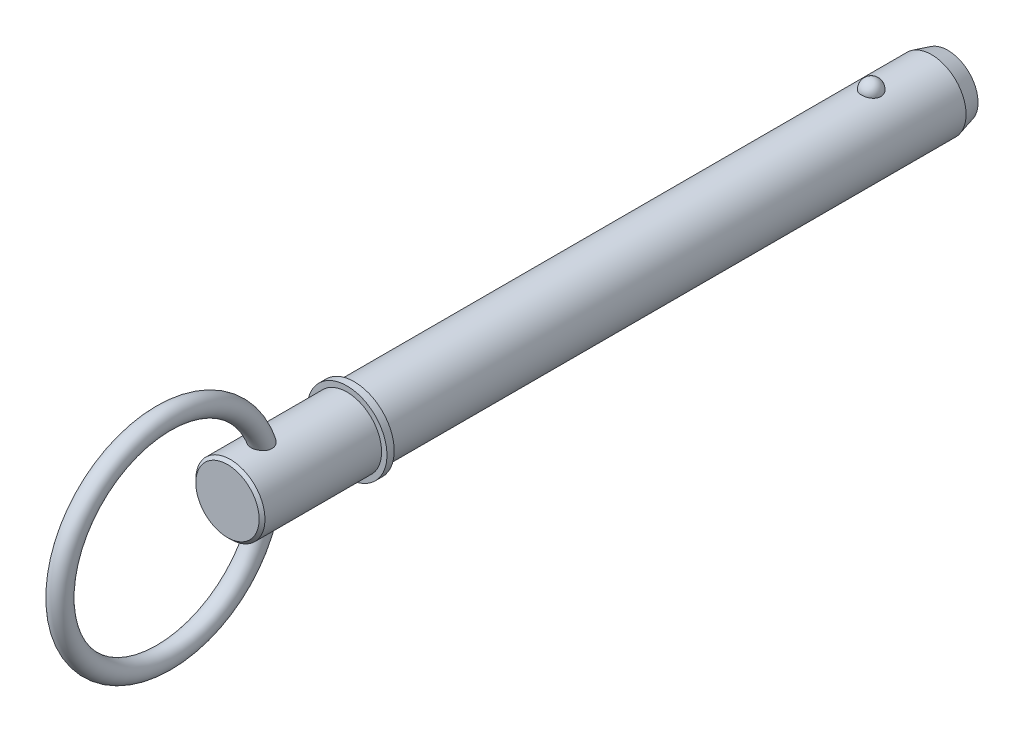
ISO-10303-21;
HEADER;
FILE_DESCRIPTION(('STEP AP214'),'2;1');
FILE_NAME('part.step','',(''),(''),'','','');
FILE_SCHEMA(('AUTOMOTIVE_DESIGN { 1 0 10303 214 1 1 1 1 }'));
ENDSEC;
DATA;
#1=APPLICATION_CONTEXT('core data for automotive mechanical design processes');
#2=APPLICATION_PROTOCOL_DEFINITION('international standard','automotive_design',2000,#1);
#3=PRODUCT_CONTEXT('',#1,'mechanical');
#4=PRODUCT('Part','Part','',(#3));
#5=PRODUCT_RELATED_PRODUCT_CATEGORY('part','',(#4));
#6=PRODUCT_DEFINITION_FORMATION('','',#4);
#7=PRODUCT_DEFINITION_CONTEXT('part definition',#1,'design');
#8=PRODUCT_DEFINITION('design','',#6,#7);
#9=PRODUCT_DEFINITION_SHAPE('','',#8);
#10=(LENGTH_UNIT() NAMED_UNIT(*) SI_UNIT(.MILLI.,.METRE.));
#11=(NAMED_UNIT(*) PLANE_ANGLE_UNIT() SI_UNIT($,.RADIAN.));
#12=(NAMED_UNIT(*) SI_UNIT($,.STERADIAN.) SOLID_ANGLE_UNIT());
#13=UNCERTAINTY_MEASURE_WITH_UNIT(LENGTH_MEASURE(1.E-05),#10,'distance_accuracy_value','');
#14=(GEOMETRIC_REPRESENTATION_CONTEXT(3) GLOBAL_UNCERTAINTY_ASSIGNED_CONTEXT((#13)) GLOBAL_UNIT_ASSIGNED_CONTEXT((#10,
#11,#12)) REPRESENTATION_CONTEXT('',''));
#15=CARTESIAN_POINT('',(0.,0.,0.));
#16=DIRECTION('',(0.,0.,1.));
#17=DIRECTION('',(1.,0.,0.));
#18=AXIS2_PLACEMENT_3D('',#15,#16,#17);
#19=CARTESIAN_POINT('',(0.,0.,139.7));
#20=DIRECTION('',(0.,0.,-1.));
#21=DIRECTION('',(-1.,0.,0.));
#22=AXIS2_PLACEMENT_3D('',#19,#20,#21);
#23=CYLINDRICAL_SURFACE('',#22,9.525);
#24=CARTESIAN_POINT('',(2.66304631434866,9.14515223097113,-2.68999999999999));
#25=CARTESIAN_POINT('',(2.66304388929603,9.14515434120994,-2.53964785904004));
#26=CARTESIAN_POINT('',(2.65079171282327,9.14874785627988,-2.38926509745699));
#27=CARTESIAN_POINT('',(2.60207590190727,9.16272073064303,-2.09276319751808));
#28=CARTESIAN_POINT('',(2.5656035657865,9.17310252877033,-1.94664561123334));
#29=CARTESIAN_POINT('',(2.469373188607,9.19947238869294,-1.66290124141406));
#30=CARTESIAN_POINT('',(2.40962536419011,9.215457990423,-1.52527076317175));
#31=CARTESIAN_POINT('',(2.26832639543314,9.25124900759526,-1.26225231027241));
#32=CARTESIAN_POINT('',(2.1867756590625,9.27105435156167,-1.13686410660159));
#33=CARTESIAN_POINT('',(2.00344089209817,9.3123948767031,-0.901158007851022));
#34=CARTESIAN_POINT('',(1.90155748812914,9.33393823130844,-0.790918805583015));
#35=CARTESIAN_POINT('',(1.68043702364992,9.37626794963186,-0.589299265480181));
#36=CARTESIAN_POINT('',(1.56119995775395,9.397054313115,-0.497918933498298));
#37=CARTESIAN_POINT('',(1.30893044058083,9.43549335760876,-0.336812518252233));
#38=CARTESIAN_POINT('',(1.17593917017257,9.45315498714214,-0.267024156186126));
#39=CARTESIAN_POINT('',(0.8995966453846,9.48344056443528,-0.150749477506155));
#40=CARTESIAN_POINT('',(0.756246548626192,9.49606507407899,-0.104260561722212));
#41=CARTESIAN_POINT('',(0.466048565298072,9.51468193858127,-0.0365733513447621));
#42=CARTESIAN_POINT('',(0.319312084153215,9.52079100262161,-0.014929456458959));
#43=CARTESIAN_POINT('',(0.0241592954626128,9.52611235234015,0.00395337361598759));
#44=CARTESIAN_POINT('',(-0.124256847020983,9.5253253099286,0.00119468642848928));
#45=CARTESIAN_POINT('',(-0.41628168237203,9.51700443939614,-0.0284230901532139));
#46=CARTESIAN_POINT('',(-0.559928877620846,9.50956858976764,-0.0549321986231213));
#47=CARTESIAN_POINT('',(-0.840604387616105,9.48887888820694,-0.130816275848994));
#48=CARTESIAN_POINT('',(-0.977632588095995,9.47562493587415,-0.180191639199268));
#49=CARTESIAN_POINT('',(-1.24212223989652,9.44460733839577,-0.300803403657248));
#50=CARTESIAN_POINT('',(-1.36952298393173,9.42681774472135,-0.372166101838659));
#51=CARTESIAN_POINT('',(-1.61053183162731,9.38864858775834,-0.534729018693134));
#52=CARTESIAN_POINT('',(-1.72413851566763,9.36826875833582,-0.625931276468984));
#53=CARTESIAN_POINT('',(-1.9367483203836,9.32666137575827,-0.827716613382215));
#54=CARTESIAN_POINT('',(-2.03542624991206,9.3054250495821,-0.938640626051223));
#55=CARTESIAN_POINT('',(-2.21301001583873,9.26480083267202,-1.17562728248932));
#56=CARTESIAN_POINT('',(-2.29191442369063,9.24541307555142,-1.3016910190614));
#57=CARTESIAN_POINT('',(-2.4288038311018,9.21040769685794,-1.56709947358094));
#58=CARTESIAN_POINT('',(-2.48653332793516,9.19483682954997,-1.70658229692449));
#59=CARTESIAN_POINT('',(-2.57830950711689,9.16952722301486,-1.99363485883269));
#60=CARTESIAN_POINT('',(-2.61235688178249,9.1597883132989,-2.14120436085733));
#61=CARTESIAN_POINT('',(-2.65582131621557,9.14728131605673,-2.43957517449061));
#62=CARTESIAN_POINT('',(-2.66534248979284,9.14448376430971,-2.59036007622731));
#63=CARTESIAN_POINT('',(-2.659816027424,9.1460926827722,-2.89143694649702));
#64=CARTESIAN_POINT('',(-2.64476907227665,9.15049895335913,-3.04172892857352));
#65=CARTESIAN_POINT('',(-2.59062526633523,9.16597303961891,-3.3367616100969));
#66=CARTESIAN_POINT('',(-2.55165119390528,9.17700684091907,-3.48152666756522));
#67=CARTESIAN_POINT('',(-2.45072334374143,9.20447158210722,-3.7622672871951));
#68=CARTESIAN_POINT('',(-2.38876863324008,9.22090274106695,-3.89824249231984));
#69=CARTESIAN_POINT('',(-2.24300082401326,9.25744165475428,-4.15838266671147));
#70=CARTESIAN_POINT('',(-2.15906901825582,9.27756919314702,-4.28247834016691));
#71=CARTESIAN_POINT('',(-1.97161008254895,9.31920445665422,-4.51460755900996));
#72=CARTESIAN_POINT('',(-1.86808218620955,9.34071223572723,-4.62264047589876));
#73=CARTESIAN_POINT('',(-1.64365852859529,9.38280712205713,-4.82005417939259));
#74=CARTESIAN_POINT('',(-1.52269814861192,9.40339041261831,-4.90936239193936));
#75=CARTESIAN_POINT('',(-1.26696810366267,9.44124442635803,-5.06628635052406));
#76=CARTESIAN_POINT('',(-1.13219941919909,9.45851538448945,-5.13390363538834));
#77=CARTESIAN_POINT('',(-0.854427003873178,9.48761400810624,-5.24478918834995));
#78=CARTESIAN_POINT('',(-0.711548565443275,9.49950757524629,-5.28835378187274));
#79=CARTESIAN_POINT('',(-0.420167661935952,9.51684639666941,-5.35116010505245));
#80=CARTESIAN_POINT('',(-0.271665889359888,9.52229244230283,-5.3704048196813));
#81=CARTESIAN_POINT('',(0.0236961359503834,9.52609381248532,-5.38387805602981));
#82=CARTESIAN_POINT('',(0.170533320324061,9.52458300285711,-5.37857884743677));
#83=CARTESIAN_POINT('',(0.461166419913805,9.51494050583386,-5.34419624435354));
#84=CARTESIAN_POINT('',(0.604962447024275,9.50680906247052,-5.31511372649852));
#85=CARTESIAN_POINT('',(0.884899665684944,9.48484202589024,-5.23415185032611));
#86=CARTESIAN_POINT('',(1.02106863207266,9.47102889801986,-5.18236222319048));
#87=CARTESIAN_POINT('',(1.28268503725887,9.43915933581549,-5.05742910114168));
#88=CARTESIAN_POINT('',(1.40813178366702,9.421102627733,-4.98428422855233));
#89=CARTESIAN_POINT('',(1.64690915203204,9.38233399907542,-4.8172920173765));
#90=CARTESIAN_POINT('',(1.76002050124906,9.36158508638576,-4.72313982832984));
#91=CARTESIAN_POINT('',(1.96897358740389,9.31987907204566,-4.51732444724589));
#92=CARTESIAN_POINT('',(2.06481234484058,9.29892193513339,-4.40565824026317));
#93=CARTESIAN_POINT('',(2.23837433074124,9.25869342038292,-4.16566572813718));
#94=CARTESIAN_POINT('',(2.31574652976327,9.23945848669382,-4.03707931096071));
#95=CARTESIAN_POINT('',(2.44818540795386,9.20525491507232,-3.76840633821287));
#96=CARTESIAN_POINT('',(2.50325979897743,9.19028480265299,-3.6283237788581));
#97=CARTESIAN_POINT('',(2.58510224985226,9.16757716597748,-3.35610038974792));
#98=CARTESIAN_POINT('',(2.61427951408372,9.15923447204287,-3.2247283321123));
#99=CARTESIAN_POINT('',(2.6532524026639,9.14802112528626,-2.95891229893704));
#100=CARTESIAN_POINT('',(2.66304848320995,9.1451503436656,-2.82446839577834));
#101=CARTESIAN_POINT('',(2.66304631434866,9.14515223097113,-2.68999999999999));
#102=B_SPLINE_CURVE_WITH_KNOTS('',3,(#24,#25,#26,#27,#28,#29,#30,#31,#32,#33,#34,#35,#36,#37,
#38,#39,#40,#41,#42,#43,#44,#45,#46,#47,#48,#49,#50,#51,#52,#53,#54,#55,#56,#57,#58,#59,#60,#61,
#62,#63,#64,#65,#66,#67,#68,#69,#70,#71,#72,#73,#74,#75,#76,#77,#78,#79,#80,#81,#82,#83,#84,#85,
#86,#87,#88,#89,#90,#91,#92,#93,#94,#95,#96,#97,#98,#99,#100,#101),.UNSPECIFIED.,.T.,.F.,(4,2,2,
2,2,2,2,2,2,2,2,2,2,2,2,2,2,2,2,2,2,2,2,2,2,2,2,2,2,2,2,2,2,2,2,2,2,2,4),(0.,0.450573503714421,
0.901308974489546,1.35184682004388,1.80237623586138,2.25516399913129,2.70795190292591,
3.15942136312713,3.61084044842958,4.0540301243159,4.49717661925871,4.9338984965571,
5.37062791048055,5.80991423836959,6.24924573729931,6.69708004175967,7.1449466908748,
7.5980522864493,8.0511446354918,8.50231041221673,8.95346368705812,9.40232106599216,
9.85119666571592,10.3025487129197,10.7539184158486,11.2070064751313,11.6600623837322,
12.1074045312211,12.5546917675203,12.9934085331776,13.4321091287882,13.8690915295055,
14.3061021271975,14.7499227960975,15.1938199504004,15.6455814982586,16.0971866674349,
16.5001694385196,16.9031427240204),.UNSPECIFIED.);
#103=CARTESIAN_POINT('',(2.66304631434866,9.14515223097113,-2.68999999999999));
#104=VERTEX_POINT('',#103);
#105=EDGE_CURVE('E100',#104,#104,#102,.T.);
#106=ORIENTED_EDGE('',*,*,#105,.T.);
#107=EDGE_LOOP('',(#106));
#108=FACE_BOUND('',#107,.T.);
#109=CARTESIAN_POINT('',(0.,0.,-19.3));
#110=DIRECTION('',(0.,0.,-1.));
#111=DIRECTION('',(-1.,0.,0.));
#112=AXIS2_PLACEMENT_3D('',#109,#110,#111);
#113=CIRCLE('',#112,9.525);
#114=CARTESIAN_POINT('',(-9.525,0.,-19.3));
#115=VERTEX_POINT('',#114);
#116=EDGE_CURVE('E108',#115,#115,#113,.F.);
#117=ORIENTED_EDGE('',*,*,#116,.T.);
#118=EDGE_LOOP('',(#117));
#119=FACE_BOUND('',#118,.T.);
#120=CARTESIAN_POINT('',(0.,0.,139.7));
#121=DIRECTION('',(0.,0.,1.));
#122=DIRECTION('',(1.,0.,0.));
#123=AXIS2_PLACEMENT_3D('',#120,#121,#122);
#124=CIRCLE('',#123,9.525);
#125=CARTESIAN_POINT('',(9.525,0.,139.7));
#126=VERTEX_POINT('',#125);
#127=EDGE_CURVE('E106',#126,#126,#124,.T.);
#128=ORIENTED_EDGE('',*,*,#127,.F.);
#129=EDGE_LOOP('',(#128));
#130=FACE_BOUND('',#129,.T.);
#131=ADVANCED_FACE('F39',(#108,#119,#130),#23,.T.);
#132=CARTESIAN_POINT('',(0.,0.,-23.8));
#133=DIRECTION('',(0.,0.,-1.));
#134=DIRECTION('',(-1.,0.,0.));
#135=AXIS2_PLACEMENT_3D('',#132,#133,#134);
#136=PLANE('',#135);
#137=CARTESIAN_POINT('',(0.,0.,-23.8));
#138=DIRECTION('',(0.,0.,-1.));
#139=DIRECTION('',(-1.,0.,0.));
#140=AXIS2_PLACEMENT_3D('',#137,#138,#139);
#141=CIRCLE('',#140,8.31922863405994);
#142=CARTESIAN_POINT('',(-8.31922863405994,0.,-23.8));
#143=VERTEX_POINT('',#142);
#144=EDGE_CURVE('E143',#143,#143,#141,.T.);
#145=ORIENTED_EDGE('',*,*,#144,.T.);
#146=EDGE_LOOP('',(#145));
#147=FACE_BOUND('',#146,.T.);
#148=ADVANCED_FACE('F86',(#147),#136,.T.);
#149=CARTESIAN_POINT('',(0.,0.,-23.8));
#150=DIRECTION('',(0.,0.,1.));
#151=DIRECTION('',(1.,0.,0.));
#152=AXIS2_PLACEMENT_3D('',#149,#150,#151);
#153=CONICAL_SURFACE('',#152,8.31922863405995,0.261799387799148);
#154=ORIENTED_EDGE('',*,*,#116,.F.);
#155=EDGE_LOOP('',(#154));
#156=FACE_BOUND('',#155,.T.);
#157=ORIENTED_EDGE('',*,*,#144,.F.);
#158=EDGE_LOOP('',(#157));
#159=FACE_BOUND('',#158,.T.);
#160=ADVANCED_FACE('F92',(#156,#159),#153,.T.);
#161=CARTESIAN_POINT('',(0.,9.525,-2.68999999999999));
#162=DIRECTION('',(0.,1.,0.));
#163=DIRECTION('',(0.,0.,1.));
#164=AXIS2_PLACEMENT_3D('',#161,#162,#163);
#165=SPHERICAL_SURFACE('',#164,2.69);
#166=ORIENTED_EDGE('',*,*,#105,.F.);
#167=EDGE_LOOP('',(#166));
#168=FACE_BOUND('',#167,.T.);
#169=ADVANCED_FACE('F111',(#168),#165,.T.);
#170=CARTESIAN_POINT('',(0.,0.,139.7));
#171=DIRECTION('',(0.,0.,-1.));
#172=DIRECTION('',(-1.,0.,0.));
#173=AXIS2_PLACEMENT_3D('',#170,#171,#172);
#174=PLANE('',#173);
#175=ORIENTED_EDGE('',*,*,#127,.T.);
#176=EDGE_LOOP('',(#175));
#177=FACE_BOUND('',#176,.T.);
#178=CARTESIAN_POINT('',(0.,0.,139.7));
#179=DIRECTION('',(0.,0.,-1.));
#180=DIRECTION('',(-1.,0.,0.));
#181=AXIS2_PLACEMENT_3D('',#178,#179,#180);
#182=CIRCLE('',#181,11.);
#183=CARTESIAN_POINT('',(-11.,0.,139.7));
#184=VERTEX_POINT('',#183);
#185=EDGE_CURVE('E107',#184,#184,#182,.T.);
#186=ORIENTED_EDGE('',*,*,#185,.T.);
#187=EDGE_LOOP('',(#186));
#188=FACE_BOUND('',#187,.T.);
#189=ADVANCED_FACE('F115',(#177,#188),#174,.T.);
#190=CARTESIAN_POINT('',(0.,0.,33.7287874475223));
#191=DIRECTION('',(0.,0.,-1.));
#192=DIRECTION('',(-1.,0.,0.));
#193=AXIS2_PLACEMENT_3D('',#190,#191,#192);
#194=CYLINDRICAL_SURFACE('',#193,11.);
#195=CARTESIAN_POINT('',(0.,0.,141.7));
#196=DIRECTION('',(0.,0.,-1.));
#197=DIRECTION('',(-1.,0.,0.));
#198=AXIS2_PLACEMENT_3D('',#195,#196,#197);
#199=CIRCLE('',#198,11.);
#200=CARTESIAN_POINT('',(-11.,0.,141.7));
#201=VERTEX_POINT('',#200);
#202=EDGE_CURVE('E132',#201,#201,#199,.T.);
#203=ORIENTED_EDGE('',*,*,#202,.T.);
#204=EDGE_LOOP('',(#203));
#205=FACE_BOUND('',#204,.T.);
#206=ORIENTED_EDGE('',*,*,#185,.F.);
#207=EDGE_LOOP('',(#206));
#208=FACE_BOUND('',#207,.T.);
#209=ADVANCED_FACE('F119',(#205,#208),#194,.T.);
#210=CARTESIAN_POINT('',(0.,11.,141.7));
#211=DIRECTION('',(0.,0.,1.));
#212=DIRECTION('',(1.,0.,0.));
#213=AXIS2_PLACEMENT_3D('',#210,#211,#212);
#214=PLANE('',#213);
#215=CARTESIAN_POINT('',(0.,0.,141.7));
#216=DIRECTION('',(0.,0.,1.));
#217=DIRECTION('',(1.,0.,0.));
#218=AXIS2_PLACEMENT_3D('',#215,#216,#217);
#219=CIRCLE('',#218,9.525);
#220=CARTESIAN_POINT('',(9.525,0.,141.7));
#221=VERTEX_POINT('',#220);
#222=EDGE_CURVE('E110',#221,#221,#219,.T.);
#223=ORIENTED_EDGE('',*,*,#222,.F.);
#224=EDGE_LOOP('',(#223));
#225=FACE_BOUND('',#224,.T.);
#226=ORIENTED_EDGE('',*,*,#202,.F.);
#227=EDGE_LOOP('',(#226));
#228=FACE_BOUND('',#227,.T.);
#229=ADVANCED_FACE('F83',(#225,#228),#214,.T.);
#230=CARTESIAN_POINT('',(0.,0.,174.63));
#231=DIRECTION('',(0.,0.,-1.));
#232=DIRECTION('',(-1.,0.,0.));
#233=AXIS2_PLACEMENT_3D('',#230,#231,#232);
#234=CYLINDRICAL_SURFACE('',#233,9.525);
#235=CARTESIAN_POINT('',(-1.17255022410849,-9.45255262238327,162.615681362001));
#236=CARTESIAN_POINT('',(-1.03279041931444,-9.46988901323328,162.552058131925));
#237=CARTESIAN_POINT('',(-0.887457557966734,-9.48474288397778,162.500036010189));
#238=CARTESIAN_POINT('',(-0.589790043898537,-9.50789357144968,162.420301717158));
#239=CARTESIAN_POINT('',(-0.437456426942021,-9.51619135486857,162.392585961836));
#240=CARTESIAN_POINT('',(-0.130095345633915,-9.52535230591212,162.362037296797));
#241=CARTESIAN_POINT('',(0.0249321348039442,-9.52621542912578,162.359204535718));
#242=CARTESIAN_POINT('',(0.333291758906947,-9.5204161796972,162.378480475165));
#243=CARTESIAN_POINT('',(0.486623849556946,-9.51375357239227,162.400589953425));
#244=CARTESIAN_POINT('',(0.78732615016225,-9.49360162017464,162.469309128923));
#245=CARTESIAN_POINT('',(0.934692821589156,-9.48010828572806,162.515933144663));
#246=CARTESIAN_POINT('',(1.21917062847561,-9.44773819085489,162.632695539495));
#247=CARTESIAN_POINT('',(1.35628163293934,-9.42886136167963,162.702834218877));
#248=CARTESIAN_POINT('',(1.61597534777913,-9.38783836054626,162.864858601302));
#249=CARTESIAN_POINT('',(1.73859309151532,-9.36570037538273,162.956690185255));
#250=CARTESIAN_POINT('',(1.96611924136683,-9.32059424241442,163.159983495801));
#251=CARTESIAN_POINT('',(2.07103000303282,-9.29762620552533,163.271442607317));
#252=CARTESIAN_POINT('',(2.25895856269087,-9.25375378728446,163.509567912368));
#253=CARTESIAN_POINT('',(2.34223089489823,-9.23282741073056,163.636029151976));
#254=CARTESIAN_POINT('',(2.48638570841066,-9.19505802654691,163.901654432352));
#255=CARTESIAN_POINT('',(2.54727152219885,-9.17821441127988,164.040816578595));
#256=CARTESIAN_POINT('',(2.64504150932,-9.15051673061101,164.326450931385));
#257=CARTESIAN_POINT('',(2.68213620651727,-9.13961026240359,164.47284631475));
#258=CARTESIAN_POINT('',(2.73308631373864,-9.1245038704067,164.769935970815));
#259=CARTESIAN_POINT('',(2.74693762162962,-9.12030513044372,164.920630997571));
#260=CARTESIAN_POINT('',(2.75225289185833,-9.11870262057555,165.228204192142));
#261=CARTESIAN_POINT('',(2.742835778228,-9.12156626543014,165.385097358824));
#262=CARTESIAN_POINT('',(2.70120500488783,-9.1339786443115,165.69553038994));
#263=CARTESIAN_POINT('',(2.66898313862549,-9.14352978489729,165.849069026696));
#264=CARTESIAN_POINT('',(2.57915721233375,-9.1692947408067,166.164317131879));
#265=CARTESIAN_POINT('',(2.51938387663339,-9.18606757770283,166.32536274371));
#266=CARTESIAN_POINT('',(2.37615490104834,-9.22415241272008,166.636112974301));
#267=CARTESIAN_POINT('',(2.29267648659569,-9.2454687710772,166.785806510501));
#268=CARTESIAN_POINT('',(2.09570343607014,-9.29218719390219,167.082005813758));
#269=CARTESIAN_POINT('',(1.98029238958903,-9.31778152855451,167.227215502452));
#270=CARTESIAN_POINT('',(1.72523060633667,-9.36835235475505,167.494631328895));
#271=CARTESIAN_POINT('',(1.58560973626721,-9.39332956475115,167.61686542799));
#272=CARTESIAN_POINT('',(1.31999418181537,-9.43381163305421,167.806542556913));
#273=CARTESIAN_POINT('',(1.1984987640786,-9.45016352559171,167.880111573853));
#274=CARTESIAN_POINT('',(0.944726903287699,-9.47889043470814,168.006555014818));
#275=CARTESIAN_POINT('',(0.812460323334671,-9.4912690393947,168.05944811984));
#276=CARTESIAN_POINT('',(0.539385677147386,-9.51070487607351,168.141579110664));
#277=CARTESIAN_POINT('',(0.398529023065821,-9.51772807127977,168.170665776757));
#278=CARTESIAN_POINT('',(0.113692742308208,-9.52538430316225,168.20234627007));
#279=CARTESIAN_POINT('',(-0.0302854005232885,-9.52602031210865,168.204952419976));
#280=CARTESIAN_POINT('',(-0.301067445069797,-9.52110324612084,168.184638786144));
#281=CARTESIAN_POINT('',(-0.428091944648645,-9.51619084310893,168.164361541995));
#282=CARTESIAN_POINT('',(-0.676960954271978,-9.50173118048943,168.103770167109));
#283=CARTESIAN_POINT('',(-0.79880468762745,-9.49218322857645,168.063453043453));
#284=CARTESIAN_POINT('',(-1.03743276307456,-9.4691126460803,167.963797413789));
#285=CARTESIAN_POINT('',(-1.15402581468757,-9.45550022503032,167.904026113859));
#286=CARTESIAN_POINT('',(-1.37707059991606,-9.42560278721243,167.768465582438));
#287=CARTESIAN_POINT('',(-1.48351822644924,-9.40931669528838,167.692669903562));
#288=CARTESIAN_POINT('',(-1.70022776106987,-9.37276249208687,167.515206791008));
#289=CARTESIAN_POINT('',(-1.80866644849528,-9.35226352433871,167.411363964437));
#290=CARTESIAN_POINT('',(-2.00947431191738,-9.31118474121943,167.18916467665));
#291=CARTESIAN_POINT('',(-2.10183201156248,-9.29060487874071,167.070797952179));
#292=CARTESIAN_POINT('',(-2.28343646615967,-9.24779116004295,166.801723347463));
#293=CARTESIAN_POINT('',(-2.36963977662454,-9.22584708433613,166.648904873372));
#294=CARTESIAN_POINT('',(-2.51731958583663,-9.18665215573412,166.331108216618));
#295=CARTESIAN_POINT('',(-2.57878214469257,-9.16940395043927,166.166123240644));
#296=CARTESIAN_POINT('',(-2.67771284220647,-9.14102404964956,165.817906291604));
#297=CARTESIAN_POINT('',(-2.71355979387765,-9.13031106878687,165.634171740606));
#298=CARTESIAN_POINT('',(-2.75239325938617,-9.11868499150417,165.262939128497));
#299=CARTESIAN_POINT('',(-2.75540326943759,-9.11776488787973,165.075443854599));
#300=CARTESIAN_POINT('',(-2.72755769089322,-9.12612848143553,164.718233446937));
#301=CARTESIAN_POINT('',(-2.69938579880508,-9.1346036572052,164.548293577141));
#302=CARTESIAN_POINT('',(-2.6128234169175,-9.15973790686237,164.21694195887));
#303=CARTESIAN_POINT('',(-2.5544530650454,-9.17639152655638,164.055524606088));
#304=CARTESIAN_POINT('',(-2.41575064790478,-9.21381352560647,163.762262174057));
#305=CARTESIAN_POINT('',(-2.33810564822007,-9.23402440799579,163.629067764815));
#306=CARTESIAN_POINT('',(-2.1611059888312,-9.27704240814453,163.378436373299));
#307=CARTESIAN_POINT('',(-2.06174995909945,-9.29984968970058,163.26100038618));
#308=CARTESIAN_POINT('',(-1.84046167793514,-9.34620233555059,163.041444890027));
#309=CARTESIAN_POINT('',(-1.71787459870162,-9.36974632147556,162.93998498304));
#310=CARTESIAN_POINT('',(-1.45637301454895,-9.41393415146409,162.760085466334));
#311=CARTESIAN_POINT('',(-1.31745717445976,-9.43457775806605,162.681647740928));
#312=CARTESIAN_POINT('',(-1.17255022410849,-9.45255262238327,162.615681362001));
#313=B_SPLINE_CURVE_WITH_KNOTS('',3,(#235,#236,#237,#238,#239,#240,#241,#242,#243,#244,#245,
#246,#247,#248,#249,#250,#251,#252,#253,#254,#255,#256,#257,#258,#259,#260,#261,#262,#263,#264,
#265,#266,#267,#268,#269,#270,#271,#272,#273,#274,#275,#276,#277,#278,#279,#280,#281,#282,#283,
#284,#285,#286,#287,#288,#289,#290,#291,#292,#293,#294,#295,#296,#297,#298,#299,#300,#301,#302,
#303,#304,#305,#306,#307,#308,#309,#310,#311,#312),.UNSPECIFIED.,.T.,.F.,(4,2,2,2,2,2,2,2,2,2,2,
2,2,2,2,2,2,2,2,2,2,2,2,2,2,2,2,2,2,2,2,2,2,2,2,2,2,2,4),(0.,0.463035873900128,
0.926003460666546,1.38897381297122,1.8519586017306,2.31521411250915,2.77847553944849,
3.24059321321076,3.70264936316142,4.15899535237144,4.61527338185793,5.06745604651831,
5.51971850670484,5.98936669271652,6.45918397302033,6.97482863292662,7.49097038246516,
8.04995658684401,8.60825803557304,9.03545685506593,9.462268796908,9.89177127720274,
10.3210738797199,10.7054535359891,11.0898906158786,11.4835430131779,11.8773540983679,
12.3302409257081,12.7834496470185,13.3116493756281,13.8401462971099,14.3996817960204,
14.9588168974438,15.4733264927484,15.9874934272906,16.4516692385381,16.915874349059,
17.3959238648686,17.8760126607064),.UNSPECIFIED.);
#314=CARTESIAN_POINT('',(-1.17255022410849,-9.45255262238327,162.615681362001));
#315=VERTEX_POINT('',#314);
#316=EDGE_CURVE('E10',#315,#315,#313,.T.);
#317=ORIENTED_EDGE('',*,*,#316,.F.);
#318=EDGE_LOOP('',(#317));
#319=FACE_BOUND('',#318,.T.);
#320=CARTESIAN_POINT('',(-1.17255022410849,9.45255262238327,162.615681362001));
#321=CARTESIAN_POINT('',(-1.31058061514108,9.43543238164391,162.678514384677));
#322=CARTESIAN_POINT('',(-1.44315063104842,9.41589375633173,162.752651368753));
#323=CARTESIAN_POINT('',(-1.69365345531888,9.37407591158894,162.921892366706));
#324=CARTESIAN_POINT('',(-1.81158925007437,9.35179725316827,163.016992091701));
#325=CARTESIAN_POINT('',(-2.02956633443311,9.30692788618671,163.22596768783));
#326=CARTESIAN_POINT('',(-2.12959463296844,9.28433696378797,163.339857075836));
#327=CARTESIAN_POINT('',(-2.30883055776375,9.24139869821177,163.58334578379));
#328=CARTESIAN_POINT('',(-2.38804080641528,9.22105107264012,163.712943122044));
#329=CARTESIAN_POINT('',(-2.52289811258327,9.18506690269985,163.982637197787));
#330=CARTESIAN_POINT('',(-2.57879510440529,9.16938093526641,164.122602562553));
#331=CARTESIAN_POINT('',(-2.66732862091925,9.14402087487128,164.410194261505));
#332=CARTESIAN_POINT('',(-2.6999643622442,9.13434698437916,164.557820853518));
#333=CARTESIAN_POINT('',(-2.74234854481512,9.12171311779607,164.858709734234));
#334=CARTESIAN_POINT('',(-2.75176419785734,9.11885078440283,165.012022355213));
#335=CARTESIAN_POINT('',(-2.74768995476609,9.12007747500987,165.318282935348));
#336=CARTESIAN_POINT('',(-2.73419331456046,9.12416854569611,165.471230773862));
#337=CARTESIAN_POINT('',(-2.6838140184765,9.13911977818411,165.785048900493));
#338=CARTESIAN_POINT('',(-2.64520186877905,9.15047943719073,165.945615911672));
#339=CARTESIAN_POINT('',(-2.54485320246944,9.17889121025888,166.258878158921));
#340=CARTESIAN_POINT('',(-2.48309922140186,9.19594762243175,166.411567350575));
#341=CARTESIAN_POINT('',(-2.33056913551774,9.23584987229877,166.721122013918));
#342=CARTESIAN_POINT('',(-2.23745101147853,9.25911216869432,166.876784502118));
#343=CARTESIAN_POINT('',(-2.02674425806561,9.307501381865,167.170279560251));
#344=CARTESIAN_POINT('',(-1.90916388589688,9.33262766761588,167.308118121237));
#345=CARTESIAN_POINT('',(-1.67044606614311,9.37804498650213,167.542015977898));
#346=CARTESIAN_POINT('',(-1.55243875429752,9.39849934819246,167.641240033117));
#347=CARTESIAN_POINT('',(-1.30125310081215,9.43654625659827,167.819193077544));
#348=CARTESIAN_POINT('',(-1.16808326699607,9.45414039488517,167.897933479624));
#349=CARTESIAN_POINT('',(-0.958516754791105,9.47691412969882,167.997606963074));
#350=CARTESIAN_POINT('',(-0.886649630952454,9.48392776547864,168.027860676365));
#351=CARTESIAN_POINT('',(-0.740281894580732,9.49647248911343,168.081484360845));
#352=CARTESIAN_POINT('',(-0.665782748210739,9.50200438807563,168.104858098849));
#353=CARTESIAN_POINT('',(-0.514804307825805,9.51137811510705,168.1442294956));
#354=CARTESIAN_POINT('',(-0.438326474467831,9.51522115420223,168.160232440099));
#355=CARTESIAN_POINT('',(-0.284116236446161,9.52107513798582,168.184532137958));
#356=CARTESIAN_POINT('',(-0.206384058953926,9.52308641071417,168.192830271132));
#357=CARTESIAN_POINT('',(0.00463957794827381,9.5259225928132,168.20454519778));
#358=CARTESIAN_POINT('',(0.138460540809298,9.52491109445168,168.200394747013));
#359=CARTESIAN_POINT('',(0.403152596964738,9.51738801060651,168.169251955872));
#360=CARTESIAN_POINT('',(0.534023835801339,9.51087669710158,168.142260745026));
#361=CARTESIAN_POINT('',(0.783985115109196,9.49347484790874,168.068806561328));
#362=CARTESIAN_POINT('',(0.903337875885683,9.48277338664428,168.023181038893));
#363=CARTESIAN_POINT('',(1.1336366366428,9.45800893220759,167.914928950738));
#364=CARTESIAN_POINT('',(1.24458027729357,9.44394500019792,167.852297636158));
#365=CARTESIAN_POINT('',(1.46880911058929,9.41182796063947,167.704389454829));
#366=CARTESIAN_POINT('',(1.58087386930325,9.3935013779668,167.617328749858));
#367=CARTESIAN_POINT('',(1.79132420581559,9.35565274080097,167.428247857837));
#368=CARTESIAN_POINT('',(1.88970126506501,9.33612995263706,167.326218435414));
#369=CARTESIAN_POINT('',(2.08778125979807,9.29401761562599,167.090997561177));
#370=CARTESIAN_POINT('',(2.18473298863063,9.27148591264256,166.95547341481));
#371=CARTESIAN_POINT('',(2.35733954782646,9.22911075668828,166.671030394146));
#372=CARTESIAN_POINT('',(2.43297838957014,9.20926932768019,166.522101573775));
#373=CARTESIAN_POINT('',(2.56843139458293,9.17247322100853,166.197269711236));
#374=CARTESIAN_POINT('',(2.6256192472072,9.15606955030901,166.020196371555));
#375=CARTESIAN_POINT('',(2.70930664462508,9.13166037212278,165.658330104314));
#376=CARTESIAN_POINT('',(2.73581406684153,9.12365270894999,165.473539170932));
#377=CARTESIAN_POINT('',(2.7551261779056,9.11784049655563,165.109017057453));
#378=CARTESIAN_POINT('',(2.74917791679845,9.11965839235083,164.929361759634));
#379=CARTESIAN_POINT('',(2.70473277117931,9.13294027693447,164.574499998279));
#380=CARTESIAN_POINT('',(2.66626406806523,9.14439591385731,164.399289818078));
#381=CARTESIAN_POINT('',(2.56263844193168,9.17393184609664,164.078469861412));
#382=CARTESIAN_POINT('',(2.50080069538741,9.19116614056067,163.931704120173));
#383=CARTESIAN_POINT('',(2.35244847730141,9.23024728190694,163.65189992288));
#384=CARTESIAN_POINT('',(2.26593972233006,9.25209305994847,163.518858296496));
#385=CARTESIAN_POINT('',(2.07585352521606,9.29652853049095,163.277145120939));
#386=CARTESIAN_POINT('',(1.97340753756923,9.31901931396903,163.167562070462));
#387=CARTESIAN_POINT('',(1.75142335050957,9.36327537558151,162.967179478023));
#388=CARTESIAN_POINT('',(1.63188535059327,9.38504066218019,162.876379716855));
#389=CARTESIAN_POINT('',(1.37826267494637,9.42563474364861,162.715168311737));
#390=CARTESIAN_POINT('',(1.24409194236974,9.44444438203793,162.644887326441));
#391=CARTESIAN_POINT('',(0.965562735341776,9.47697010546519,162.526996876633));
#392=CARTESIAN_POINT('',(0.821203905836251,9.4906860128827,162.479388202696));
#393=CARTESIAN_POINT('',(0.524366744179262,9.51173338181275,162.407369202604));
#394=CARTESIAN_POINT('',(0.371807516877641,9.5189799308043,162.383267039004));
#395=CARTESIAN_POINT('',(0.0646112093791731,9.52602042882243,162.359842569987));
#396=CARTESIAN_POINT('',(-0.0900262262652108,9.52581308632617,162.360524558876));
#397=CARTESIAN_POINT('',(-0.404139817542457,9.51777767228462,162.387276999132));
#398=CARTESIAN_POINT('',(-0.563508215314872,9.50959696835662,162.414522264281));
#399=CARTESIAN_POINT('',(-0.874799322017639,9.48602809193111,162.495533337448));
#400=CARTESIAN_POINT('',(-1.02672214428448,9.47064002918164,162.54929874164));
#401=CARTESIAN_POINT('',(-1.17255022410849,9.45255262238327,162.615681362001));
#402=B_SPLINE_CURVE_WITH_KNOTS('',3,(#320,#321,#322,#323,#324,#325,#326,#327,#328,#329,#330,
#331,#332,#333,#334,#335,#336,#337,#338,#339,#340,#341,#342,#343,#344,#345,#346,#347,#348,#349,
#350,#351,#352,#353,#354,#355,#356,#357,#358,#359,#360,#361,#362,#363,#364,#365,#366,#367,#368,
#369,#370,#371,#372,#373,#374,#375,#376,#377,#378,#379,#380,#381,#382,#383,#384,#385,#386,#387,
#388,#389,#390,#391,#392,#393,#394,#395,#396,#397,#398,#399,#400,#401),.UNSPECIFIED.,.T.,.F.,(4,
2,2,2,2,2,2,2,2,2,2,2,2,2,2,2,2,2,2,2,2,2,2,2,2,2,2,2,2,2,2,2,2,2,2,2,2,2,2,2,4),(0.,
0.457306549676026,0.914519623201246,1.37206305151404,1.82954881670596,2.28199545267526,
2.73445732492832,3.19336710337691,3.65241198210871,4.14699278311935,4.64194758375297,
5.18812269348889,5.73411374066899,6.19889752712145,6.66342179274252,6.89799214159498,
7.13243382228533,7.36670711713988,7.60093844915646,8.00032434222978,8.39969048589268,
8.78279802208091,9.16601265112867,9.59366701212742,10.0215863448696,10.5240084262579,
11.0268064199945,11.5844522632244,12.1419548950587,12.6781910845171,13.213963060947,
13.6920531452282,14.1700325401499,14.6229745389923,15.0759112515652,15.5316722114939,
15.9874490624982,16.4491237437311,16.91087841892,17.3940267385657,17.8771677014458),.UNSPECIFIED.);
#403=CARTESIAN_POINT('',(-1.17255022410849,9.45255262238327,162.615681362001));
#404=VERTEX_POINT('',#403);
#405=EDGE_CURVE('E51',#404,#404,#402,.T.);
#406=ORIENTED_EDGE('',*,*,#405,.F.);
#407=EDGE_LOOP('',(#406));
#408=FACE_BOUND('',#407,.T.);
#409=CARTESIAN_POINT('',(0.,0.,173.83));
#410=DIRECTION('',(0.,0.,-1.));
#411=DIRECTION('',(-1.,0.,0.));
#412=AXIS2_PLACEMENT_3D('',#409,#410,#411);
#413=CIRCLE('',#412,9.525);
#414=CARTESIAN_POINT('',(-9.525,0.,173.83));
#415=VERTEX_POINT('',#414);
#416=EDGE_CURVE('E62',#415,#415,#413,.T.);
#417=ORIENTED_EDGE('',*,*,#416,.T.);
#418=EDGE_LOOP('',(#417));
#419=FACE_BOUND('',#418,.T.);
#420=ORIENTED_EDGE('',*,*,#222,.T.);
#421=EDGE_LOOP('',(#420));
#422=FACE_BOUND('',#421,.T.);
#423=ADVANCED_FACE('F67',(#319,#408,#419,#422),#234,.T.);
#424=CARTESIAN_POINT('',(0.,0.,174.63));
#425=DIRECTION('',(0.,0.,-1.));
#426=DIRECTION('',(-1.,0.,0.));
#427=AXIS2_PLACEMENT_3D('',#424,#425,#426);
#428=PLANE('',#427);
#429=CARTESIAN_POINT('',(0.,0.,174.63));
#430=DIRECTION('',(0.,0.,-1.));
#431=DIRECTION('',(-1.,0.,0.));
#432=AXIS2_PLACEMENT_3D('',#429,#430,#431);
#433=CIRCLE('',#432,8.72499999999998);
#434=CARTESIAN_POINT('',(-8.72499999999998,0.,174.63));
#435=VERTEX_POINT('',#434);
#436=EDGE_CURVE('E56',#435,#435,#433,.F.);
#437=ORIENTED_EDGE('',*,*,#436,.T.);
#438=EDGE_LOOP('',(#437));
#439=FACE_BOUND('',#438,.T.);
#440=ADVANCED_FACE('F74',(#439),#428,.F.);
#441=CARTESIAN_POINT('',(0.,0.,173.83));
#442=DIRECTION('',(0.,0.,-1.));
#443=DIRECTION('',(-1.,0.,0.));
#444=AXIS2_PLACEMENT_3D('',#441,#442,#443);
#445=CONICAL_SURFACE('',#444,9.525,0.785398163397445);
#446=ORIENTED_EDGE('',*,*,#436,.F.);
#447=EDGE_LOOP('',(#446));
#448=FACE_BOUND('',#447,.T.);
#449=ORIENTED_EDGE('',*,*,#416,.F.);
#450=EDGE_LOOP('',(#449));
#451=FACE_BOUND('',#450,.T.);
#452=ADVANCED_FACE('F41',(#448,#451),#445,.T.);
#453=CARTESIAN_POINT('',(0.,0.,192.205));
#454=DIRECTION('',(1.,0.,0.));
#455=DIRECTION('',(0.,0.,-1.));
#456=AXIS2_PLACEMENT_3D('',#453,#454,#455);
#457=TOROIDAL_SURFACE('',#456,28.575,2.75);
#458=ORIENTED_EDGE('',*,*,#316,.T.);
#459=EDGE_LOOP('',(#458));
#460=FACE_BOUND('',#459,.T.);
#461=ORIENTED_EDGE('',*,*,#405,.T.);
#462=EDGE_LOOP('',(#461));
#463=FACE_BOUND('',#462,.T.);
#464=ADVANCED_FACE('F71',(#460,#463),#457,.T.);
#465=CLOSED_SHELL('',(#131,#148,#160,#169,#189,#209,#229,#423,#440,#452,#464));
#466=MANIFOLD_SOLID_BREP('B2',#465);
#467=ADVANCED_BREP_SHAPE_REPRESENTATION('',(#18,#466),#14);
#468=SHAPE_DEFINITION_REPRESENTATION(#9,#467);
ENDSEC;
END-ISO-10303-21;
